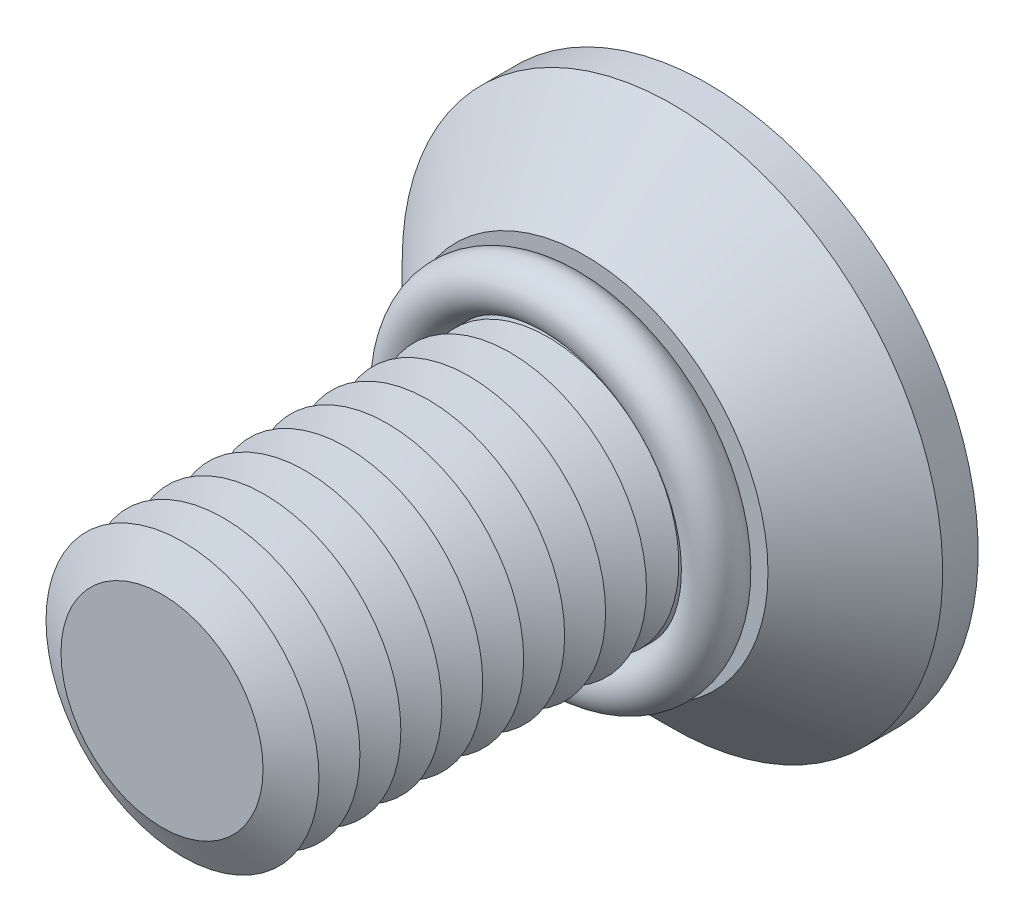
ISO-10303-21;
HEADER;
FILE_DESCRIPTION(('STEP AP214'),'2;1');
FILE_NAME('part.step','',(''),(''),'','','');
FILE_SCHEMA(('AUTOMOTIVE_DESIGN { 1 0 10303 214 1 1 1 1 }'));
ENDSEC;
DATA;
#1=APPLICATION_CONTEXT('core data for automotive mechanical design processes');
#2=APPLICATION_PROTOCOL_DEFINITION('international standard','automotive_design',2000,#1);
#3=PRODUCT_CONTEXT('',#1,'mechanical');
#4=PRODUCT('Part','Part','',(#3));
#5=PRODUCT_RELATED_PRODUCT_CATEGORY('part','',(#4));
#6=PRODUCT_DEFINITION_FORMATION('','',#4);
#7=PRODUCT_DEFINITION_CONTEXT('part definition',#1,'design');
#8=PRODUCT_DEFINITION('design','',#6,#7);
#9=PRODUCT_DEFINITION_SHAPE('','',#8);
#10=(LENGTH_UNIT() NAMED_UNIT(*) SI_UNIT(.MILLI.,.METRE.));
#11=(NAMED_UNIT(*) PLANE_ANGLE_UNIT() SI_UNIT($,.RADIAN.));
#12=(NAMED_UNIT(*) SI_UNIT($,.STERADIAN.) SOLID_ANGLE_UNIT());
#13=UNCERTAINTY_MEASURE_WITH_UNIT(LENGTH_MEASURE(1.E-05),#10,'distance_accuracy_value','');
#14=(GEOMETRIC_REPRESENTATION_CONTEXT(3) GLOBAL_UNCERTAINTY_ASSIGNED_CONTEXT((#13)) GLOBAL_UNIT_ASSIGNED_CONTEXT((#10,
#11,#12)) REPRESENTATION_CONTEXT('',''));
#15=CARTESIAN_POINT('',(0.,0.,0.));
#16=DIRECTION('',(0.,0.,1.));
#17=DIRECTION('',(1.,0.,0.));
#18=AXIS2_PLACEMENT_3D('',#15,#16,#17);
#19=CARTESIAN_POINT('',(0.,0.,5.39999999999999));
#20=DIRECTION('',(0.,0.,1.));
#21=DIRECTION('',(1.,0.,0.));
#22=AXIS2_PLACEMENT_3D('',#19,#20,#21);
#23=TOROIDAL_SURFACE('',#22,5.7,0.9);
#24=CARTESIAN_POINT('',(0.,5.7,5.39999999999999));
#25=DIRECTION('',(1.,0.,0.));
#26=DIRECTION('',(0.,0.,-1.));
#27=AXIS2_PLACEMENT_3D('',#24,#25,#26);
#28=CIRCLE('',#27,0.9);
#29=CARTESIAN_POINT('',(0.,6.6,5.39999999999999));
#30=VERTEX_POINT('',#29);
#31=EDGE_CURVE('P0_E10',#30,#30,#28,.T.);
#32=CARTESIAN_POINT('',(0.,0.,5.39999999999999));
#33=DIRECTION('',(0.,0.,1.));
#34=DIRECTION('',(1.,0.,0.));
#35=AXIS2_PLACEMENT_3D('',#32,#33,#34);
#36=CIRCLE('',#35,6.6);
#37=EDGE_CURVE('',#30,#30,#36,.T.);
#38=ORIENTED_EDGE('',*,*,#31,.F.);
#39=ORIENTED_EDGE('',*,*,#31,.T.);
#40=ORIENTED_EDGE('',*,*,#37,.T.);
#41=ORIENTED_EDGE('',*,*,#37,.F.);
#42=EDGE_LOOP('',(#38,#40,#39,#41));
#43=FACE_BOUND('',#42,.T.);
#44=ADVANCED_FACE('P0_F14',(#43),#23,.T.);
#45=CLOSED_SHELL('',(#44));
#46=MANIFOLD_SOLID_BREP('P0_B1',#45);
#47=CARTESIAN_POINT('',(0.,0.,12.5));
#48=DIRECTION('',(0.,0.,-1.));
#49=DIRECTION('',(-1.,0.,0.));
#50=AXIS2_PLACEMENT_3D('',#47,#48,#49);
#51=CONICAL_SURFACE('',#50,3.70096189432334,1.0471975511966);
#52=CARTESIAN_POINT('',(0.,0.,11.75));
#53=DIRECTION('',(0.,0.,1.));
#54=DIRECTION('',(1.,0.,0.));
#55=AXIS2_PLACEMENT_3D('',#52,#53,#54);
#56=CIRCLE('',#55,5.);
#57=CARTESIAN_POINT('',(5.,0.,11.75));
#58=VERTEX_POINT('',#57);
#59=EDGE_CURVE('P1_E324',#58,#58,#56,.T.);
#60=ORIENTED_EDGE('',*,*,#59,.T.);
#61=EDGE_LOOP('',(#60));
#62=FACE_BOUND('',#61,.T.);
#63=CARTESIAN_POINT('',(0.,0.,12.5));
#64=DIRECTION('',(0.,0.,1.));
#65=DIRECTION('',(1.,0.,0.));
#66=AXIS2_PLACEMENT_3D('',#63,#64,#65);
#67=CIRCLE('',#66,3.70096189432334);
#68=CARTESIAN_POINT('',(3.70096189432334,0.,12.5));
#69=VERTEX_POINT('',#68);
#70=EDGE_CURVE('P1_E321',#69,#69,#67,.T.);
#71=ORIENTED_EDGE('',*,*,#70,.F.);
#72=EDGE_LOOP('',(#71));
#73=FACE_BOUND('',#72,.T.);
#74=ADVANCED_FACE('P1_F15',(#62,#73),#51,.T.);
#75=CARTESIAN_POINT('',(0.,0.,13.25));
#76=DIRECTION('',(0.,0.,1.));
#77=DIRECTION('',(1.,0.,0.));
#78=AXIS2_PLACEMENT_3D('',#75,#76,#77);
#79=CONICAL_SURFACE('',#78,5.,1.0471975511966);
#80=ORIENTED_EDGE('',*,*,#70,.T.);
#81=EDGE_LOOP('',(#80));
#82=FACE_BOUND('',#81,.T.);
#83=CARTESIAN_POINT('',(0.,0.,13.25));
#84=DIRECTION('',(0.,0.,1.));
#85=DIRECTION('',(1.,0.,0.));
#86=AXIS2_PLACEMENT_3D('',#83,#84,#85);
#87=CIRCLE('',#86,5.);
#88=CARTESIAN_POINT('',(5.,0.,13.25));
#89=VERTEX_POINT('',#88);
#90=EDGE_CURVE('P1_E318',#89,#89,#87,.T.);
#91=ORIENTED_EDGE('',*,*,#90,.F.);
#92=EDGE_LOOP('',(#91));
#93=FACE_BOUND('',#92,.T.);
#94=ADVANCED_FACE('P1_F245',(#82,#93),#79,.T.);
#95=CARTESIAN_POINT('',(0.,0.,20.));
#96=DIRECTION('',(0.,0.,1.));
#97=DIRECTION('',(1.,0.,0.));
#98=AXIS2_PLACEMENT_3D('',#95,#96,#97);
#99=PLANE('',#98);
#100=CARTESIAN_POINT('',(0.,0.,20.));
#101=DIRECTION('',(0.,0.,1.));
#102=DIRECTION('',(1.,0.,0.));
#103=AXIS2_PLACEMENT_3D('',#100,#101,#102);
#104=CIRCLE('',#103,3.70096189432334);
#105=CARTESIAN_POINT('',(3.70096189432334,0.,20.));
#106=VERTEX_POINT('',#105);
#107=EDGE_CURVE('P1_E131',#106,#106,#104,.T.);
#108=ORIENTED_EDGE('',*,*,#107,.T.);
#109=EDGE_LOOP('',(#108));
#110=FACE_BOUND('',#109,.T.);
#111=ADVANCED_FACE('P1_F251',(#110),#99,.T.);
#112=CARTESIAN_POINT('',(0.,0.,20.));
#113=DIRECTION('',(0.,0.,-1.));
#114=DIRECTION('',(-1.,0.,0.));
#115=AXIS2_PLACEMENT_3D('',#112,#113,#114);
#116=CONICAL_SURFACE('',#115,3.70096189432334,1.0471975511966);
#117=CARTESIAN_POINT('',(0.,0.,19.25));
#118=DIRECTION('',(0.,0.,1.));
#119=DIRECTION('',(1.,0.,0.));
#120=AXIS2_PLACEMENT_3D('',#117,#118,#119);
#121=CIRCLE('',#120,5.);
#122=CARTESIAN_POINT('',(5.,0.,19.25));
#123=VERTEX_POINT('',#122);
#124=EDGE_CURVE('P1_E133',#123,#123,#121,.T.);
#125=ORIENTED_EDGE('',*,*,#124,.T.);
#126=EDGE_LOOP('',(#125));
#127=FACE_BOUND('',#126,.T.);
#128=ORIENTED_EDGE('',*,*,#107,.F.);
#129=EDGE_LOOP('',(#128));
#130=FACE_BOUND('',#129,.T.);
#131=ADVANCED_FACE('P1_F196',(#127,#130),#116,.T.);
#132=CARTESIAN_POINT('',(0.,0.,19.25));
#133=DIRECTION('',(0.,0.,1.));
#134=DIRECTION('',(1.,0.,0.));
#135=AXIS2_PLACEMENT_3D('',#132,#133,#134);
#136=CONICAL_SURFACE('',#135,5.,1.0471975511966);
#137=CARTESIAN_POINT('',(0.,0.,18.5));
#138=DIRECTION('',(0.,0.,1.));
#139=DIRECTION('',(1.,0.,0.));
#140=AXIS2_PLACEMENT_3D('',#137,#138,#139);
#141=CIRCLE('',#140,3.70096189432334);
#142=CARTESIAN_POINT('',(3.70096189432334,0.,18.5));
#143=VERTEX_POINT('',#142);
#144=EDGE_CURVE('P1_E297',#143,#143,#141,.T.);
#145=ORIENTED_EDGE('',*,*,#144,.T.);
#146=EDGE_LOOP('',(#145));
#147=FACE_BOUND('',#146,.T.);
#148=ORIENTED_EDGE('',*,*,#124,.F.);
#149=EDGE_LOOP('',(#148));
#150=FACE_BOUND('',#149,.T.);
#151=ADVANCED_FACE('P1_F284',(#147,#150),#136,.T.);
#152=CARTESIAN_POINT('',(0.,0.,18.5));
#153=DIRECTION('',(0.,0.,-1.));
#154=DIRECTION('',(-1.,0.,0.));
#155=AXIS2_PLACEMENT_3D('',#152,#153,#154);
#156=CONICAL_SURFACE('',#155,3.70096189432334,1.0471975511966);
#157=CARTESIAN_POINT('',(0.,0.,17.75));
#158=DIRECTION('',(0.,0.,1.));
#159=DIRECTION('',(1.,0.,0.));
#160=AXIS2_PLACEMENT_3D('',#157,#158,#159);
#161=CIRCLE('',#160,5.);
#162=CARTESIAN_POINT('',(5.,0.,17.75));
#163=VERTEX_POINT('',#162);
#164=EDGE_CURVE('P1_E294',#163,#163,#161,.T.);
#165=ORIENTED_EDGE('',*,*,#164,.T.);
#166=EDGE_LOOP('',(#165));
#167=FACE_BOUND('',#166,.T.);
#168=ORIENTED_EDGE('',*,*,#144,.F.);
#169=EDGE_LOOP('',(#168));
#170=FACE_BOUND('',#169,.T.);
#171=ADVANCED_FACE('P1_F279',(#167,#170),#156,.T.);
#172=CARTESIAN_POINT('',(0.,0.,17.75));
#173=DIRECTION('',(0.,0.,1.));
#174=DIRECTION('',(1.,0.,0.));
#175=AXIS2_PLACEMENT_3D('',#172,#173,#174);
#176=CONICAL_SURFACE('',#175,5.,1.0471975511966);
#177=CARTESIAN_POINT('',(0.,0.,17.));
#178=DIRECTION('',(0.,0.,1.));
#179=DIRECTION('',(1.,0.,0.));
#180=AXIS2_PLACEMENT_3D('',#177,#178,#179);
#181=CIRCLE('',#180,3.70096189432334);
#182=CARTESIAN_POINT('',(3.70096189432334,0.,17.));
#183=VERTEX_POINT('',#182);
#184=EDGE_CURVE('P1_E301',#183,#183,#181,.T.);
#185=ORIENTED_EDGE('',*,*,#184,.T.);
#186=EDGE_LOOP('',(#185));
#187=FACE_BOUND('',#186,.T.);
#188=ORIENTED_EDGE('',*,*,#164,.F.);
#189=EDGE_LOOP('',(#188));
#190=FACE_BOUND('',#189,.T.);
#191=ADVANCED_FACE('P1_F276',(#187,#190),#176,.T.);
#192=CARTESIAN_POINT('',(0.,0.,17.));
#193=DIRECTION('',(0.,0.,-1.));
#194=DIRECTION('',(-1.,0.,0.));
#195=AXIS2_PLACEMENT_3D('',#192,#193,#194);
#196=CONICAL_SURFACE('',#195,3.70096189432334,1.0471975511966);
#197=CARTESIAN_POINT('',(0.,0.,16.25));
#198=DIRECTION('',(0.,0.,1.));
#199=DIRECTION('',(1.,0.,0.));
#200=AXIS2_PLACEMENT_3D('',#197,#198,#199);
#201=CIRCLE('',#200,5.);
#202=CARTESIAN_POINT('',(5.,0.,16.25));
#203=VERTEX_POINT('',#202);
#204=EDGE_CURVE('P1_E306',#203,#203,#201,.T.);
#205=ORIENTED_EDGE('',*,*,#204,.T.);
#206=EDGE_LOOP('',(#205));
#207=FACE_BOUND('',#206,.T.);
#208=ORIENTED_EDGE('',*,*,#184,.F.);
#209=EDGE_LOOP('',(#208));
#210=FACE_BOUND('',#209,.T.);
#211=ADVANCED_FACE('P1_F271',(#207,#210),#196,.T.);
#212=CARTESIAN_POINT('',(0.,0.,16.25));
#213=DIRECTION('',(0.,0.,1.));
#214=DIRECTION('',(1.,0.,0.));
#215=AXIS2_PLACEMENT_3D('',#212,#213,#214);
#216=CONICAL_SURFACE('',#215,5.,1.0471975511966);
#217=CARTESIAN_POINT('',(0.,0.,15.5));
#218=DIRECTION('',(0.,0.,1.));
#219=DIRECTION('',(1.,0.,0.));
#220=AXIS2_PLACEMENT_3D('',#217,#218,#219);
#221=CIRCLE('',#220,3.70096189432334);
#222=CARTESIAN_POINT('',(3.70096189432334,0.,15.5));
#223=VERTEX_POINT('',#222);
#224=EDGE_CURVE('P1_E309',#223,#223,#221,.T.);
#225=ORIENTED_EDGE('',*,*,#224,.T.);
#226=EDGE_LOOP('',(#225));
#227=FACE_BOUND('',#226,.T.);
#228=ORIENTED_EDGE('',*,*,#204,.F.);
#229=EDGE_LOOP('',(#228));
#230=FACE_BOUND('',#229,.T.);
#231=ADVANCED_FACE('P1_F268',(#227,#230),#216,.T.);
#232=CARTESIAN_POINT('',(0.,0.,15.5));
#233=DIRECTION('',(0.,0.,-1.));
#234=DIRECTION('',(-1.,0.,0.));
#235=AXIS2_PLACEMENT_3D('',#232,#233,#234);
#236=CONICAL_SURFACE('',#235,3.70096189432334,1.0471975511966);
#237=CARTESIAN_POINT('',(0.,0.,14.75));
#238=DIRECTION('',(0.,0.,1.));
#239=DIRECTION('',(1.,0.,0.));
#240=AXIS2_PLACEMENT_3D('',#237,#238,#239);
#241=CIRCLE('',#240,5.);
#242=CARTESIAN_POINT('',(5.,0.,14.75));
#243=VERTEX_POINT('',#242);
#244=EDGE_CURVE('P1_E312',#243,#243,#241,.T.);
#245=ORIENTED_EDGE('',*,*,#244,.T.);
#246=EDGE_LOOP('',(#245));
#247=FACE_BOUND('',#246,.T.);
#248=ORIENTED_EDGE('',*,*,#224,.F.);
#249=EDGE_LOOP('',(#248));
#250=FACE_BOUND('',#249,.T.);
#251=ADVANCED_FACE('P1_F262',(#247,#250),#236,.T.);
#252=CARTESIAN_POINT('',(0.,0.,14.75));
#253=DIRECTION('',(0.,0.,1.));
#254=DIRECTION('',(1.,0.,0.));
#255=AXIS2_PLACEMENT_3D('',#252,#253,#254);
#256=CONICAL_SURFACE('',#255,5.,1.0471975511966);
#257=CARTESIAN_POINT('',(0.,0.,14.));
#258=DIRECTION('',(0.,0.,1.));
#259=DIRECTION('',(1.,0.,0.));
#260=AXIS2_PLACEMENT_3D('',#257,#258,#259);
#261=CIRCLE('',#260,3.70096189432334);
#262=CARTESIAN_POINT('',(3.70096189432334,0.,14.));
#263=VERTEX_POINT('',#262);
#264=EDGE_CURVE('P1_E315',#263,#263,#261,.T.);
#265=ORIENTED_EDGE('',*,*,#264,.T.);
#266=EDGE_LOOP('',(#265));
#267=FACE_BOUND('',#266,.T.);
#268=ORIENTED_EDGE('',*,*,#244,.F.);
#269=EDGE_LOOP('',(#268));
#270=FACE_BOUND('',#269,.T.);
#271=ADVANCED_FACE('P1_F258',(#267,#270),#256,.T.);
#272=CARTESIAN_POINT('',(0.,0.,14.));
#273=DIRECTION('',(0.,0.,-1.));
#274=DIRECTION('',(-1.,0.,0.));
#275=AXIS2_PLACEMENT_3D('',#272,#273,#274);
#276=CONICAL_SURFACE('',#275,3.70096189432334,1.0471975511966);
#277=ORIENTED_EDGE('',*,*,#90,.T.);
#278=EDGE_LOOP('',(#277));
#279=FACE_BOUND('',#278,.T.);
#280=ORIENTED_EDGE('',*,*,#264,.F.);
#281=EDGE_LOOP('',(#280));
#282=FACE_BOUND('',#281,.T.);
#283=ADVANCED_FACE('P1_F261',(#279,#282),#276,.T.);
#284=CARTESIAN_POINT('',(0.,0.,11.));
#285=DIRECTION('',(0.,0.,-1.));
#286=DIRECTION('',(-1.,0.,0.));
#287=AXIS2_PLACEMENT_3D('',#284,#285,#286);
#288=CONICAL_SURFACE('',#287,3.70096189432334,1.0471975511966);
#289=CARTESIAN_POINT('',(0.,0.,10.25));
#290=DIRECTION('',(0.,0.,1.));
#291=DIRECTION('',(1.,0.,0.));
#292=AXIS2_PLACEMENT_3D('',#289,#290,#291);
#293=CIRCLE('',#292,5.);
#294=CARTESIAN_POINT('',(5.,0.,10.25));
#295=VERTEX_POINT('',#294);
#296=EDGE_CURVE('P1_E329',#295,#295,#293,.T.);
#297=ORIENTED_EDGE('',*,*,#296,.T.);
#298=EDGE_LOOP('',(#297));
#299=FACE_BOUND('',#298,.T.);
#300=CARTESIAN_POINT('',(0.,0.,11.));
#301=DIRECTION('',(0.,0.,1.));
#302=DIRECTION('',(1.,0.,0.));
#303=AXIS2_PLACEMENT_3D('',#300,#301,#302);
#304=CIRCLE('',#303,3.70096189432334);
#305=CARTESIAN_POINT('',(3.70096189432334,0.,11.));
#306=VERTEX_POINT('',#305);
#307=EDGE_CURVE('P1_E326',#306,#306,#304,.T.);
#308=ORIENTED_EDGE('',*,*,#307,.F.);
#309=EDGE_LOOP('',(#308));
#310=FACE_BOUND('',#309,.T.);
#311=ADVANCED_FACE('P1_F266',(#299,#310),#288,.T.);
#312=CARTESIAN_POINT('',(0.,0.,11.75));
#313=DIRECTION('',(0.,0.,1.));
#314=DIRECTION('',(1.,0.,0.));
#315=AXIS2_PLACEMENT_3D('',#312,#313,#314);
#316=CONICAL_SURFACE('',#315,5.,1.0471975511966);
#317=ORIENTED_EDGE('',*,*,#307,.T.);
#318=EDGE_LOOP('',(#317));
#319=FACE_BOUND('',#318,.T.);
#320=ORIENTED_EDGE('',*,*,#59,.F.);
#321=EDGE_LOOP('',(#320));
#322=FACE_BOUND('',#321,.T.);
#323=ADVANCED_FACE('P1_F449',(#319,#322),#316,.T.);
#324=CARTESIAN_POINT('',(0.,0.,9.5));
#325=DIRECTION('',(0.,0.,-1.));
#326=DIRECTION('',(-1.,0.,0.));
#327=AXIS2_PLACEMENT_3D('',#324,#325,#326);
#328=CONICAL_SURFACE('',#327,3.70096189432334,1.0471975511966);
#329=CARTESIAN_POINT('',(0.,0.,8.75));
#330=DIRECTION('',(0.,0.,1.));
#331=DIRECTION('',(1.,0.,0.));
#332=AXIS2_PLACEMENT_3D('',#329,#330,#331);
#333=CIRCLE('',#332,5.);
#334=CARTESIAN_POINT('',(5.,0.,8.75));
#335=VERTEX_POINT('',#334);
#336=EDGE_CURVE('P1_E335',#335,#335,#333,.T.);
#337=ORIENTED_EDGE('',*,*,#336,.T.);
#338=EDGE_LOOP('',(#337));
#339=FACE_BOUND('',#338,.T.);
#340=CARTESIAN_POINT('',(0.,0.,9.5));
#341=DIRECTION('',(0.,0.,1.));
#342=DIRECTION('',(1.,0.,0.));
#343=AXIS2_PLACEMENT_3D('',#340,#341,#342);
#344=CIRCLE('',#343,3.70096189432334);
#345=CARTESIAN_POINT('',(3.70096189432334,0.,9.5));
#346=VERTEX_POINT('',#345);
#347=EDGE_CURVE('P1_E332',#346,#346,#344,.T.);
#348=ORIENTED_EDGE('',*,*,#347,.F.);
#349=EDGE_LOOP('',(#348));
#350=FACE_BOUND('',#349,.T.);
#351=ADVANCED_FACE('P1_F458',(#339,#350),#328,.T.);
#352=CARTESIAN_POINT('',(0.,0.,10.25));
#353=DIRECTION('',(0.,0.,1.));
#354=DIRECTION('',(1.,0.,0.));
#355=AXIS2_PLACEMENT_3D('',#352,#353,#354);
#356=CONICAL_SURFACE('',#355,5.,1.0471975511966);
#357=ORIENTED_EDGE('',*,*,#347,.T.);
#358=EDGE_LOOP('',(#357));
#359=FACE_BOUND('',#358,.T.);
#360=ORIENTED_EDGE('',*,*,#296,.F.);
#361=EDGE_LOOP('',(#360));
#362=FACE_BOUND('',#361,.T.);
#363=ADVANCED_FACE('P1_F468',(#359,#362),#356,.T.);
#364=CARTESIAN_POINT('',(0.,0.,8.));
#365=DIRECTION('',(0.,0.,-1.));
#366=DIRECTION('',(-1.,0.,0.));
#367=AXIS2_PLACEMENT_3D('',#364,#365,#366);
#368=CONICAL_SURFACE('',#367,3.70096189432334,1.0471975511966);
#369=CARTESIAN_POINT('',(0.,0.,7.25));
#370=DIRECTION('',(0.,0.,1.));
#371=DIRECTION('',(1.,0.,0.));
#372=AXIS2_PLACEMENT_3D('',#369,#370,#371);
#373=CIRCLE('',#372,5.);
#374=CARTESIAN_POINT('',(5.,0.,7.25));
#375=VERTEX_POINT('',#374);
#376=EDGE_CURVE('P1_E341',#375,#375,#373,.T.);
#377=ORIENTED_EDGE('',*,*,#376,.T.);
#378=EDGE_LOOP('',(#377));
#379=FACE_BOUND('',#378,.T.);
#380=CARTESIAN_POINT('',(0.,0.,8.));
#381=DIRECTION('',(0.,0.,1.));
#382=DIRECTION('',(1.,0.,0.));
#383=AXIS2_PLACEMENT_3D('',#380,#381,#382);
#384=CIRCLE('',#383,3.70096189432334);
#385=CARTESIAN_POINT('',(3.70096189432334,0.,8.));
#386=VERTEX_POINT('',#385);
#387=EDGE_CURVE('P1_E338',#386,#386,#384,.T.);
#388=ORIENTED_EDGE('',*,*,#387,.F.);
#389=EDGE_LOOP('',(#388));
#390=FACE_BOUND('',#389,.T.);
#391=ADVANCED_FACE('P1_F478',(#379,#390),#368,.T.);
#392=CARTESIAN_POINT('',(0.,0.,8.75));
#393=DIRECTION('',(0.,0.,1.));
#394=DIRECTION('',(1.,0.,0.));
#395=AXIS2_PLACEMENT_3D('',#392,#393,#394);
#396=CONICAL_SURFACE('',#395,5.,1.0471975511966);
#397=ORIENTED_EDGE('',*,*,#387,.T.);
#398=EDGE_LOOP('',(#397));
#399=FACE_BOUND('',#398,.T.);
#400=ORIENTED_EDGE('',*,*,#336,.F.);
#401=EDGE_LOOP('',(#400));
#402=FACE_BOUND('',#401,.T.);
#403=ADVANCED_FACE('P1_F354',(#399,#402),#396,.T.);
#404=CARTESIAN_POINT('',(0.,0.,6.5));
#405=DIRECTION('',(0.,0.,-1.));
#406=DIRECTION('',(-1.,0.,0.));
#407=AXIS2_PLACEMENT_3D('',#404,#405,#406);
#408=CONICAL_SURFACE('',#407,3.70096189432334,1.0471975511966);
#409=CARTESIAN_POINT('',(0.,0.,6.5));
#410=DIRECTION('',(0.,0.,1.));
#411=DIRECTION('',(1.,0.,0.));
#412=AXIS2_PLACEMENT_3D('',#409,#410,#411);
#413=CIRCLE('',#412,3.70096189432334);
#414=CARTESIAN_POINT('',(3.70096189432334,0.,6.5));
#415=VERTEX_POINT('',#414);
#416=EDGE_CURVE('P1_E344',#415,#415,#413,.T.);
#417=ORIENTED_EDGE('',*,*,#416,.F.);
#418=EDGE_LOOP('',(#417));
#419=FACE_BOUND('',#418,.T.);
#420=CARTESIAN_POINT('',(0.,0.,5.86547005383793));
#421=DIRECTION('',(0.,0.,-1.));
#422=DIRECTION('',(-1.,0.,0.));
#423=AXIS2_PLACEMENT_3D('',#420,#421,#422);
#424=CIRCLE('',#423,4.8);
#425=CARTESIAN_POINT('',(-4.8,0.,5.86547005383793));
#426=VERTEX_POINT('',#425);
#427=EDGE_CURVE('P1_E19',#426,#426,#424,.F.);
#428=ORIENTED_EDGE('',*,*,#427,.T.);
#429=EDGE_LOOP('',(#428));
#430=FACE_BOUND('',#429,.T.);
#431=ADVANCED_FACE('P1_F351',(#419,#430),#408,.T.);
#432=CARTESIAN_POINT('',(0.,0.,7.25));
#433=DIRECTION('',(0.,0.,1.));
#434=DIRECTION('',(1.,0.,0.));
#435=AXIS2_PLACEMENT_3D('',#432,#433,#434);
#436=CONICAL_SURFACE('',#435,5.,1.0471975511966);
#437=ORIENTED_EDGE('',*,*,#416,.T.);
#438=EDGE_LOOP('',(#437));
#439=FACE_BOUND('',#438,.T.);
#440=ORIENTED_EDGE('',*,*,#376,.F.);
#441=EDGE_LOOP('',(#440));
#442=FACE_BOUND('',#441,.T.);
#443=ADVANCED_FACE('P1_F348',(#439,#442),#436,.T.);
#444=CARTESIAN_POINT('',(0.,0.,4.));
#445=DIRECTION('',(0.,0.,-1.));
#446=DIRECTION('',(-1.,0.,0.));
#447=AXIS2_PLACEMENT_3D('',#444,#445,#446);
#448=CONICAL_SURFACE('',#447,3.,1.0471975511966);
#449=CARTESIAN_POINT('',(0.,0.,5.73205080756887));
#450=VERTEX_POINT('',#449);
#451=VERTEX_LOOP('',#450);
#452=FACE_BOUND('',#451,.T.);
#453=CARTESIAN_POINT('',(0.,0.,4.));
#454=DIRECTION('',(0.,0.,-1.));
#455=DIRECTION('',(-1.,0.,0.));
#456=AXIS2_PLACEMENT_3D('',#453,#454,#455);
#457=CIRCLE('',#456,3.);
#458=CARTESIAN_POINT('',(-3.,0.,4.));
#459=VERTEX_POINT('',#458);
#460=CARTESIAN_POINT('',(-1.5,2.59807621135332,4.));
#461=VERTEX_POINT('',#460);
#462=EDGE_CURVE('P1_E117',#459,#461,#457,.T.);
#463=ORIENTED_EDGE('',*,*,#462,.T.);
#464=CARTESIAN_POINT('',(0.,0.,4.));
#465=DIRECTION('',(0.,0.,-1.));
#466=DIRECTION('',(-1.,0.,0.));
#467=AXIS2_PLACEMENT_3D('',#464,#465,#466);
#468=CIRCLE('',#467,3.);
#469=CARTESIAN_POINT('',(1.5,2.59807621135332,4.));
#470=VERTEX_POINT('',#469);
#471=EDGE_CURVE('P1_E24',#461,#470,#468,.T.);
#472=ORIENTED_EDGE('',*,*,#471,.T.);
#473=CARTESIAN_POINT('',(3.,0.,4.));
#474=VERTEX_POINT('',#473);
#475=EDGE_CURVE('P1_E713',#470,#474,#468,.T.);
#476=ORIENTED_EDGE('',*,*,#475,.T.);
#477=CARTESIAN_POINT('',(1.5,-2.59807621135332,4.));
#478=VERTEX_POINT('',#477);
#479=EDGE_CURVE('P1_E706',#474,#478,#468,.T.);
#480=ORIENTED_EDGE('',*,*,#479,.T.);
#481=CARTESIAN_POINT('',(-1.5,-2.59807621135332,4.));
#482=VERTEX_POINT('',#481);
#483=EDGE_CURVE('P1_E182',#478,#482,#468,.T.);
#484=ORIENTED_EDGE('',*,*,#483,.T.);
#485=EDGE_CURVE('P1_E179',#482,#459,#468,.T.);
#486=ORIENTED_EDGE('',*,*,#485,.T.);
#487=EDGE_LOOP('',(#463,#472,#476,#480,#484,#486));
#488=FACE_BOUND('',#487,.T.);
#489=ADVANCED_FACE('P1_F198',(#452,#488),#448,.F.);
#490=CARTESIAN_POINT('',(0.,0.,4.));
#491=DIRECTION('',(0.,0.,-1.));
#492=DIRECTION('',(-1.,0.,0.));
#493=AXIS2_PLACEMENT_3D('',#490,#491,#492);
#494=PLANE('',#493);
#495=ORIENTED_EDGE('',*,*,#483,.F.);
#496=DIRECTION('',(-0.866025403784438,-0.5,0.));
#497=VECTOR('',#496,1.);
#498=CARTESIAN_POINT('',(3.,-1.73205080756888,4.));
#499=LINE('',#498,#497);
#500=CARTESIAN_POINT('',(0.,-3.46410161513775,4.));
#501=VERTEX_POINT('',#500);
#502=EDGE_CURVE('P1_E722',#478,#501,#499,.T.);
#503=ORIENTED_EDGE('',*,*,#502,.T.);
#504=DIRECTION('',(-0.866025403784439,0.5,0.));
#505=VECTOR('',#504,1.);
#506=CARTESIAN_POINT('',(0.,-3.46410161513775,4.));
#507=LINE('',#506,#505);
#508=EDGE_CURVE('P1_E729',#501,#482,#507,.T.);
#509=ORIENTED_EDGE('',*,*,#508,.T.);
#510=EDGE_LOOP('',(#495,#503,#509));
#511=FACE_BOUND('',#510,.T.);
#512=ADVANCED_FACE('P1_F520',(#511),#494,.T.);
#513=ORIENTED_EDGE('',*,*,#485,.F.);
#514=CARTESIAN_POINT('',(-3.,-1.73205080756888,4.));
#515=VERTEX_POINT('',#514);
#516=EDGE_CURVE('P1_E732',#482,#515,#507,.T.);
#517=ORIENTED_EDGE('',*,*,#516,.T.);
#518=DIRECTION('',(0.,1.,0.));
#519=VECTOR('',#518,1.);
#520=CARTESIAN_POINT('',(-3.,-1.73205080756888,4.));
#521=LINE('',#520,#519);
#522=EDGE_CURVE('P1_E123',#515,#459,#521,.T.);
#523=ORIENTED_EDGE('',*,*,#522,.T.);
#524=EDGE_LOOP('',(#513,#517,#523));
#525=FACE_BOUND('',#524,.T.);
#526=ADVANCED_FACE('P1_F231',(#525),#494,.T.);
#527=ORIENTED_EDGE('',*,*,#462,.F.);
#528=CARTESIAN_POINT('',(-3.,1.73205080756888,4.));
#529=VERTEX_POINT('',#528);
#530=EDGE_CURVE('P1_E734',#459,#529,#521,.T.);
#531=ORIENTED_EDGE('',*,*,#530,.T.);
#532=DIRECTION('',(0.866025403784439,0.5,0.));
#533=VECTOR('',#532,1.);
#534=CARTESIAN_POINT('',(-3.,1.73205080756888,4.));
#535=LINE('',#534,#533);
#536=EDGE_CURVE('P1_E737',#529,#461,#535,.T.);
#537=ORIENTED_EDGE('',*,*,#536,.T.);
#538=EDGE_LOOP('',(#527,#531,#537));
#539=FACE_BOUND('',#538,.T.);
#540=ADVANCED_FACE('P1_F537',(#539),#494,.T.);
#541=ORIENTED_EDGE('',*,*,#471,.F.);
#542=CARTESIAN_POINT('',(0.,3.46410161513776,4.));
#543=VERTEX_POINT('',#542);
#544=EDGE_CURVE('P1_E736',#461,#543,#535,.T.);
#545=ORIENTED_EDGE('',*,*,#544,.T.);
#546=DIRECTION('',(0.866025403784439,-0.5,0.));
#547=VECTOR('',#546,1.);
#548=CARTESIAN_POINT('',(0.,3.46410161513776,4.));
#549=LINE('',#548,#547);
#550=EDGE_CURVE('P1_E161',#543,#470,#549,.T.);
#551=ORIENTED_EDGE('',*,*,#550,.T.);
#552=EDGE_LOOP('',(#541,#545,#551));
#553=FACE_BOUND('',#552,.T.);
#554=ADVANCED_FACE('P1_F546',(#553),#494,.T.);
#555=ORIENTED_EDGE('',*,*,#475,.F.);
#556=CARTESIAN_POINT('',(3.,1.73205080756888,4.));
#557=VERTEX_POINT('',#556);
#558=EDGE_CURVE('P1_E721',#470,#557,#549,.T.);
#559=ORIENTED_EDGE('',*,*,#558,.T.);
#560=DIRECTION('',(0.,-1.,0.));
#561=VECTOR('',#560,1.);
#562=CARTESIAN_POINT('',(3.,1.73205080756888,4.));
#563=LINE('',#562,#561);
#564=EDGE_CURVE('P1_E716',#557,#474,#563,.T.);
#565=ORIENTED_EDGE('',*,*,#564,.T.);
#566=EDGE_LOOP('',(#555,#559,#565));
#567=FACE_BOUND('',#566,.T.);
#568=ADVANCED_FACE('P1_F555',(#567),#494,.T.);
#569=ORIENTED_EDGE('',*,*,#479,.F.);
#570=CARTESIAN_POINT('',(3.,-1.73205080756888,4.));
#571=VERTEX_POINT('',#570);
#572=EDGE_CURVE('P1_E708',#474,#571,#563,.T.);
#573=ORIENTED_EDGE('',*,*,#572,.T.);
#574=EDGE_CURVE('P1_E125',#571,#478,#499,.T.);
#575=ORIENTED_EDGE('',*,*,#574,.T.);
#576=EDGE_LOOP('',(#569,#573,#575));
#577=FACE_BOUND('',#576,.T.);
#578=ADVANCED_FACE('P1_F229',(#577),#494,.T.);
#579=CARTESIAN_POINT('',(3.,-1.73205080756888,4.));
#580=DIRECTION('',(0.5,-0.866025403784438,0.));
#581=DIRECTION('',(0.866025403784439,0.5,0.));
#582=AXIS2_PLACEMENT_3D('',#579,#580,#581);
#583=PLANE('',#582);
#584=DIRECTION('',(0.,0.,-1.));
#585=VECTOR('',#584,1.);
#586=CARTESIAN_POINT('',(3.,-1.73205080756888,4.));
#587=LINE('',#586,#585);
#588=CARTESIAN_POINT('',(3.,-1.73205080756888,0.));
#589=VERTEX_POINT('',#588);
#590=EDGE_CURVE('P1_E164',#571,#589,#587,.T.);
#591=ORIENTED_EDGE('',*,*,#590,.T.);
#592=CARTESIAN_POINT('',(3.0002,-1.73193533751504,-3.09416546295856E-05));
#593=CARTESIAN_POINT('',(2.8756009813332,-1.80387261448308,0.0192538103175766));
#594=CARTESIAN_POINT('',(2.75077603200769,-1.87594033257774,0.036761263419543));
#595=CARTESIAN_POINT('',(2.50068525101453,-2.02033031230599,0.067520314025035));
#596=CARTESIAN_POINT('',(2.37541926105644,-2.0926526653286,0.0807701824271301));
#597=CARTESIAN_POINT('',(2.12520598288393,-2.23711336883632,0.102240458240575));
#598=CARTESIAN_POINT('',(2.00026038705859,-2.30925074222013,0.110486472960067));
#599=CARTESIAN_POINT('',(1.75020983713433,-2.45361749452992,0.121543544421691));
#600=CARTESIAN_POINT('',(1.62510491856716,-2.52584685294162,0.12435565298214));
#601=CARTESIAN_POINT('',(1.37489508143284,-2.67030556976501,0.12435565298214));
#602=CARTESIAN_POINT('',(1.24979016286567,-2.74253492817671,0.121543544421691));
#603=CARTESIAN_POINT('',(0.99973961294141,-2.8869016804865,0.110486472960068));
#604=CARTESIAN_POINT('',(0.874794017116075,-2.95903905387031,0.102240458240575));
#605=CARTESIAN_POINT('',(0.62458073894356,-3.10349975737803,0.0807701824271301));
#606=CARTESIAN_POINT('',(0.499314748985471,-3.17582211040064,0.067520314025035));
#607=CARTESIAN_POINT('',(0.249223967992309,-3.32021209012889,0.036761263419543));
#608=CARTESIAN_POINT('',(0.124399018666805,-3.39227980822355,0.0192538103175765));
#609=CARTESIAN_POINT('',(-0.000199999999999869,-3.46421708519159,-3.09416546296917E-05));
#610=B_SPLINE_CURVE_WITH_KNOTS('',3,(#592,#593,#594,#595,#596,#597,#598,#599,#600,#601,#602,
#603,#604,#605,#606,#607,#608,#609),.UNSPECIFIED.,.F.,.F.,(4,2,2,2,2,2,2,2,4),(0.,
0.435506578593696,0.871189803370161,1.30462418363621,1.73797465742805,2.17132513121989,
2.60475951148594,3.0404427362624,3.4759493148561),.UNSPECIFIED.);
#611=CARTESIAN_POINT('',(0.,-3.46410161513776,0.));
#612=VERTEX_POINT('',#611);
#613=EDGE_CURVE('P1_E118',#589,#612,#610,.T.);
#614=ORIENTED_EDGE('',*,*,#613,.T.);
#615=DIRECTION('',(0.,0.,-1.));
#616=VECTOR('',#615,1.);
#617=CARTESIAN_POINT('',(0.,-3.46410161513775,4.));
#618=LINE('',#617,#616);
#619=EDGE_CURVE('P1_E116',#501,#612,#618,.T.);
#620=ORIENTED_EDGE('',*,*,#619,.F.);
#621=ORIENTED_EDGE('',*,*,#502,.F.);
#622=ORIENTED_EDGE('',*,*,#574,.F.);
#623=EDGE_LOOP('',(#591,#614,#620,#621,#622));
#624=FACE_BOUND('',#623,.T.);
#625=ADVANCED_FACE('P1_F226',(#624),#583,.F.);
#626=CARTESIAN_POINT('',(0.,-3.46410161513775,4.));
#627=DIRECTION('',(-0.5,-0.866025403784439,0.));
#628=DIRECTION('',(0.866025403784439,-0.5,0.));
#629=AXIS2_PLACEMENT_3D('',#626,#627,#628);
#630=PLANE('',#629);
#631=ORIENTED_EDGE('',*,*,#619,.T.);
#632=CARTESIAN_POINT('',(0.000200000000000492,-3.46421708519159,-3.09416546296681E-05));
#633=CARTESIAN_POINT('',(-0.124399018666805,-3.39227980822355,0.0192538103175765));
#634=CARTESIAN_POINT('',(-0.249223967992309,-3.32021209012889,0.036761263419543));
#635=CARTESIAN_POINT('',(-0.49931474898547,-3.17582211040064,0.0675203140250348));
#636=CARTESIAN_POINT('',(-0.62458073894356,-3.10349975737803,0.08077018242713));
#637=CARTESIAN_POINT('',(-0.874794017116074,-2.95903905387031,0.102240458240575));
#638=CARTESIAN_POINT('',(-0.999739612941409,-2.8869016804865,0.110486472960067));
#639=CARTESIAN_POINT('',(-1.24979016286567,-2.74253492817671,0.121543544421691));
#640=CARTESIAN_POINT('',(-1.37489508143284,-2.67030556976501,0.12435565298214));
#641=CARTESIAN_POINT('',(-1.62510491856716,-2.52584685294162,0.12435565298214));
#642=CARTESIAN_POINT('',(-1.75020983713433,-2.45361749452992,0.12154354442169));
#643=CARTESIAN_POINT('',(-2.00026038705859,-2.30925074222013,0.110486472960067));
#644=CARTESIAN_POINT('',(-2.12520598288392,-2.23711336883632,0.102240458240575));
#645=CARTESIAN_POINT('',(-2.37541926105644,-2.0926526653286,0.08077018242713));
#646=CARTESIAN_POINT('',(-2.50068525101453,-2.02033031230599,0.0675203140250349));
#647=CARTESIAN_POINT('',(-2.75077603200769,-1.87594033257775,0.036761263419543));
#648=CARTESIAN_POINT('',(-2.87560098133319,-1.80387261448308,0.0192538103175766));
#649=CARTESIAN_POINT('',(-3.0002,-1.73193533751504,-3.09416546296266E-05));
#650=B_SPLINE_CURVE_WITH_KNOTS('',3,(#632,#633,#634,#635,#636,#637,#638,#639,#640,#641,#642,
#643,#644,#645,#646,#647,#648,#649),.UNSPECIFIED.,.F.,.F.,(4,2,2,2,2,2,2,2,4),(0.,
0.435506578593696,0.87118980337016,1.3046241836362,1.73797465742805,2.17132513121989,
2.60475951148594,3.0404427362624,3.4759493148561),.UNSPECIFIED.);
#651=CARTESIAN_POINT('',(-3.,-1.73205080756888,0.));
#652=VERTEX_POINT('',#651);
#653=EDGE_CURVE('P1_E94',#612,#652,#650,.T.);
#654=ORIENTED_EDGE('',*,*,#653,.T.);
#655=DIRECTION('',(0.,0.,-1.));
#656=VECTOR('',#655,1.);
#657=CARTESIAN_POINT('',(-3.,-1.73205080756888,4.));
#658=LINE('',#657,#656);
#659=EDGE_CURVE('P1_E112',#515,#652,#658,.T.);
#660=ORIENTED_EDGE('',*,*,#659,.F.);
#661=ORIENTED_EDGE('',*,*,#516,.F.);
#662=ORIENTED_EDGE('',*,*,#508,.F.);
#663=EDGE_LOOP('',(#631,#654,#660,#661,#662));
#664=FACE_BOUND('',#663,.T.);
#665=ADVANCED_FACE('P1_F110',(#664),#630,.F.);
#666=CARTESIAN_POINT('',(-3.,-1.73205080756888,4.));
#667=DIRECTION('',(-1.,0.,0.));
#668=DIRECTION('',(0.,-1.,0.));
#669=AXIS2_PLACEMENT_3D('',#666,#667,#668);
#670=PLANE('',#669);
#671=ORIENTED_EDGE('',*,*,#659,.T.);
#672=CARTESIAN_POINT('',(-3.,-4.52161137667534,-0.525775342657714));
#673=CARTESIAN_POINT('',(-3.,-4.38614690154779,-0.495537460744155));
#674=CARTESIAN_POINT('',(-3.,-4.25059605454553,-0.465680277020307));
#675=CARTESIAN_POINT('',(-3.,-3.97927914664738,-0.406931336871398));
#676=CARTESIAN_POINT('',(-3.,-3.84351307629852,-0.378039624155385));
#677=CARTESIAN_POINT('',(-3.,-3.57159492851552,-0.321399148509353));
#678=CARTESIAN_POINT('',(-3.,-3.43544259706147,-0.293651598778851));
#679=CARTESIAN_POINT('',(-3.,-3.16285056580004,-0.239614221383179));
#680=CARTESIAN_POINT('',(-3.,-3.02641086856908,-0.213324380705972));
#681=CARTESIAN_POINT('',(-3.,-2.61896324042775,-0.137569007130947));
#682=CARTESIAN_POINT('',(-3.,-2.34745999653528,-0.090713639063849));
#683=CARTESIAN_POINT('',(-3.,-1.80279754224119,-0.00770905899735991));
#684=CARTESIAN_POINT('',(-3.,-1.52963867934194,0.0284423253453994));
#685=CARTESIAN_POINT('',(-3.,-1.11712206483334,0.0711149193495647));
#686=CARTESIAN_POINT('',(-3.,-0.978367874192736,0.0834493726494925));
#687=CARTESIAN_POINT('',(-3.,-0.700531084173,0.103508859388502));
#688=CARTESIAN_POINT('',(-3.,-0.561448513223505,0.11123427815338));
#689=CARTESIAN_POINT('',(-3.,-0.283146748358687,0.121626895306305));
#690=CARTESIAN_POINT('',(-3.,-0.143927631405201,0.124296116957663));
#691=CARTESIAN_POINT('',(-3.,0.134513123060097,0.124413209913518));
#692=CARTESIAN_POINT('',(-3.,0.273734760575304,0.121861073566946));
#693=CARTESIAN_POINT('',(-3.,0.552556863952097,0.111676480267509));
#694=CARTESIAN_POINT('',(-3.,0.692156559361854,0.104023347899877));
#695=CARTESIAN_POINT('',(-3.,0.971024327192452,0.08406484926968));
#696=CARTESIAN_POINT('',(-3.,1.11029238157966,0.071759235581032));
#697=CARTESIAN_POINT('',(-3.,1.3884939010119,0.0431025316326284));
#698=CARTESIAN_POINT('',(-3.,1.52742710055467,0.0267489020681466));
#699=CARTESIAN_POINT('',(-3.,1.80484805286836,-0.00934194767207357));
#700=CARTESIAN_POINT('',(-3.,1.94333580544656,-0.0290791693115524));
#701=CARTESIAN_POINT('',(-3.,2.2235029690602,-0.0718742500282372));
#702=CARTESIAN_POINT('',(-3.,2.36517107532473,-0.0950054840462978));
#703=CARTESIAN_POINT('',(-3.,2.648104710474,-0.143617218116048));
#704=CARTESIAN_POINT('',(-3.,2.78937022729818,-0.169097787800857));
#705=CARTESIAN_POINT('',(-3.,3.21267286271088,-0.248342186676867));
#706=CARTESIAN_POINT('',(-3.,3.49418463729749,-0.304903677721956));
#707=CARTESIAN_POINT('',(-3.,4.05626646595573,-0.422827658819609));
#708=CARTESIAN_POINT('',(-3.,4.33683622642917,-0.484191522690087));
#709=CARTESIAN_POINT('',(-3.,4.89726247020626,-0.610112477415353));
#710=CARTESIAN_POINT('',(-3.,5.17711893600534,-0.67466964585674));
#711=CARTESIAN_POINT('',(-3.,5.73290235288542,-0.80517176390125));
#712=CARTESIAN_POINT('',(-3.,6.00883557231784,-0.87109015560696));
#713=CARTESIAN_POINT('',(-3.,6.56033924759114,-1.00445136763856));
#714=CARTESIAN_POINT('',(-3.,6.83590969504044,-1.07189422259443));
#715=CARTESIAN_POINT('',(-3.,7.38639195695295,-1.20779575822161));
#716=CARTESIAN_POINT('',(-3.,7.66130415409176,-1.27625289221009));
#717=CARTESIAN_POINT('',(-3.,8.21090603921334,-1.41401333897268));
#718=CARTESIAN_POINT('',(-3.,8.48559573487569,-1.48331662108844));
#719=CARTESIAN_POINT('',(-3.,8.76020986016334,-1.55291480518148));
#720=B_SPLINE_CURVE_WITH_KNOTS('',3,(#672,#673,#674,#675,#676,#677,#678,#679,#680,#681,#682,
#683,#684,#685,#686,#687,#688,#689,#690,#691,#692,#693,#694,#695,#696,#697,#698,#699,#700,#701,
#702,#703,#704,#705,#706,#707,#708,#709,#710,#711,#712,#713,#714,#715,#716,#717,#718,#719),
.UNSPECIFIED.,.F.,.F.,(4,2,2,2,2,2,2,2,2,2,2,2,2,2,2,2,2,2,2,2,2,2,2,4),(0.,0.416396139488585,
0.832811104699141,1.24965681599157,1.66649880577,2.49292514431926,3.31918364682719,
3.73702338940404,4.1548281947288,4.57246577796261,4.99010397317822,5.40944532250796,
5.82880897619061,6.24843636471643,6.66806393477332,7.09867155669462,7.52929194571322,
8.39062817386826,9.25221171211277,10.1138161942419,10.9649037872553,11.8160107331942,
12.6659315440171,13.5158216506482),.UNSPECIFIED.);
#721=CARTESIAN_POINT('',(-3.,1.73205080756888,0.));
#722=VERTEX_POINT('',#721);
#723=EDGE_CURVE('P1_E10',#652,#722,#720,.T.);
#724=ORIENTED_EDGE('',*,*,#723,.T.);
#725=DIRECTION('',(0.,0.,-1.));
#726=VECTOR('',#725,1.);
#727=CARTESIAN_POINT('',(-3.,1.73205080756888,4.));
#728=LINE('',#727,#726);
#729=EDGE_CURVE('P1_E124',#529,#722,#728,.T.);
#730=ORIENTED_EDGE('',*,*,#729,.F.);
#731=ORIENTED_EDGE('',*,*,#530,.F.);
#732=ORIENTED_EDGE('',*,*,#522,.F.);
#733=EDGE_LOOP('',(#671,#724,#730,#731,#732));
#734=FACE_BOUND('',#733,.T.);
#735=ADVANCED_FACE('P1_F120',(#734),#670,.F.);
#736=CARTESIAN_POINT('',(-3.,1.73205080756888,4.));
#737=DIRECTION('',(-0.5,0.866025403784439,0.));
#738=DIRECTION('',(-0.866025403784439,-0.5,0.));
#739=AXIS2_PLACEMENT_3D('',#736,#737,#738);
#740=PLANE('',#739);
#741=ORIENTED_EDGE('',*,*,#729,.T.);
#742=CARTESIAN_POINT('',(-3.0002,1.73193533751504,-3.09416546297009E-05));
#743=CARTESIAN_POINT('',(-2.87560098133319,1.80387261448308,0.0192538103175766));
#744=CARTESIAN_POINT('',(-2.75077603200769,1.87594033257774,0.036761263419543));
#745=CARTESIAN_POINT('',(-2.50068525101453,2.02033031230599,0.0675203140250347));
#746=CARTESIAN_POINT('',(-2.37541926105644,2.0926526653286,0.0807701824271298));
#747=CARTESIAN_POINT('',(-2.12520598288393,2.23711336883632,0.102240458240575));
#748=CARTESIAN_POINT('',(-2.00026038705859,2.30925074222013,0.110486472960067));
#749=CARTESIAN_POINT('',(-1.75020983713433,2.45361749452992,0.12154354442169));
#750=CARTESIAN_POINT('',(-1.62510491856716,2.52584685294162,0.124355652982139));
#751=CARTESIAN_POINT('',(-1.37489508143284,2.67030556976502,0.124355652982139));
#752=CARTESIAN_POINT('',(-1.24979016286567,2.74253492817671,0.12154354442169));
#753=CARTESIAN_POINT('',(-0.999739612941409,2.8869016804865,0.110486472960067));
#754=CARTESIAN_POINT('',(-0.874794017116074,2.95903905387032,0.102240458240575));
#755=CARTESIAN_POINT('',(-0.62458073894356,3.10349975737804,0.0807701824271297));
#756=CARTESIAN_POINT('',(-0.499314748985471,3.17582211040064,0.0675203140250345));
#757=CARTESIAN_POINT('',(-0.249223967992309,3.32021209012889,0.0367612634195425));
#758=CARTESIAN_POINT('',(-0.124399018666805,3.39227980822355,0.019253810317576));
#759=CARTESIAN_POINT('',(0.000200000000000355,3.46421708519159,-3.09416546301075E-05));
#760=B_SPLINE_CURVE_WITH_KNOTS('',3,(#742,#743,#744,#745,#746,#747,#748,#749,#750,#751,#752,
#753,#754,#755,#756,#757,#758,#759),.UNSPECIFIED.,.F.,.F.,(4,2,2,2,2,2,2,2,4),(0.,
0.435506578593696,0.87118980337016,1.3046241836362,1.73797465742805,2.17132513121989,
2.60475951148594,3.0404427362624,3.4759493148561),.UNSPECIFIED.);
#761=CARTESIAN_POINT('',(0.,3.46410161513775,0.));
#762=VERTEX_POINT('',#761);
#763=EDGE_CURVE('P1_E136',#722,#762,#760,.T.);
#764=ORIENTED_EDGE('',*,*,#763,.T.);
#765=DIRECTION('',(0.,0.,-1.));
#766=VECTOR('',#765,1.);
#767=CARTESIAN_POINT('',(0.,3.46410161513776,4.));
#768=LINE('',#767,#766);
#769=EDGE_CURVE('P1_E155',#543,#762,#768,.T.);
#770=ORIENTED_EDGE('',*,*,#769,.F.);
#771=ORIENTED_EDGE('',*,*,#544,.F.);
#772=ORIENTED_EDGE('',*,*,#536,.F.);
#773=EDGE_LOOP('',(#741,#764,#770,#771,#772));
#774=FACE_BOUND('',#773,.T.);
#775=ADVANCED_FACE('P1_F153',(#774),#740,.F.);
#776=CARTESIAN_POINT('',(0.,3.46410161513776,4.));
#777=DIRECTION('',(0.5,0.866025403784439,0.));
#778=DIRECTION('',(-0.866025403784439,0.5,0.));
#779=AXIS2_PLACEMENT_3D('',#776,#777,#778);
#780=PLANE('',#779);
#781=ORIENTED_EDGE('',*,*,#769,.T.);
#782=CARTESIAN_POINT('',(-0.000199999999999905,3.46421708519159,-3.09416546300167E-05));
#783=CARTESIAN_POINT('',(0.124399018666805,3.39227980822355,0.0192538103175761));
#784=CARTESIAN_POINT('',(0.249223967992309,3.32021209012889,0.0367612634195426));
#785=CARTESIAN_POINT('',(0.499314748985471,3.17582211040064,0.0675203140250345));
#786=CARTESIAN_POINT('',(0.624580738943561,3.10349975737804,0.0807701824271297));
#787=CARTESIAN_POINT('',(0.874794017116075,2.95903905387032,0.102240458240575));
#788=CARTESIAN_POINT('',(0.99973961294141,2.8869016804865,0.110486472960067));
#789=CARTESIAN_POINT('',(1.24979016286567,2.74253492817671,0.12154354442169));
#790=CARTESIAN_POINT('',(1.37489508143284,2.67030556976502,0.124355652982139));
#791=CARTESIAN_POINT('',(1.62510491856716,2.52584685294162,0.124355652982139));
#792=CARTESIAN_POINT('',(1.75020983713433,2.45361749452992,0.12154354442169));
#793=CARTESIAN_POINT('',(2.00026038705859,2.30925074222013,0.110486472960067));
#794=CARTESIAN_POINT('',(2.12520598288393,2.23711336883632,0.102240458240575));
#795=CARTESIAN_POINT('',(2.37541926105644,2.0926526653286,0.0807701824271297));
#796=CARTESIAN_POINT('',(2.50068525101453,2.02033031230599,0.0675203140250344));
#797=CARTESIAN_POINT('',(2.75077603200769,1.87594033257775,0.0367612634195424));
#798=CARTESIAN_POINT('',(2.8756009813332,1.80387261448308,0.0192538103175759));
#799=CARTESIAN_POINT('',(3.0002,1.73193533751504,-3.09416546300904E-05));
#800=B_SPLINE_CURVE_WITH_KNOTS('',3,(#782,#783,#784,#785,#786,#787,#788,#789,#790,#791,#792,
#793,#794,#795,#796,#797,#798,#799),.UNSPECIFIED.,.F.,.F.,(4,2,2,2,2,2,2,2,4),(0.,
0.435506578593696,0.87118980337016,1.3046241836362,1.73797465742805,2.17132513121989,
2.60475951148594,3.0404427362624,3.4759493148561),.UNSPECIFIED.);
#801=CARTESIAN_POINT('',(3.,1.73205080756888,0.));
#802=VERTEX_POINT('',#801);
#803=EDGE_CURVE('P1_E141',#762,#802,#800,.T.);
#804=ORIENTED_EDGE('',*,*,#803,.T.);
#805=DIRECTION('',(0.,0.,-1.));
#806=VECTOR('',#805,1.);
#807=CARTESIAN_POINT('',(3.,1.73205080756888,4.));
#808=LINE('',#807,#806);
#809=EDGE_CURVE('P1_E162',#557,#802,#808,.T.);
#810=ORIENTED_EDGE('',*,*,#809,.F.);
#811=ORIENTED_EDGE('',*,*,#558,.F.);
#812=ORIENTED_EDGE('',*,*,#550,.F.);
#813=EDGE_LOOP('',(#781,#804,#810,#811,#812));
#814=FACE_BOUND('',#813,.T.);
#815=ADVANCED_FACE('P1_F158',(#814),#780,.F.);
#816=CARTESIAN_POINT('',(3.,1.73205080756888,4.));
#817=DIRECTION('',(1.,0.,0.));
#818=DIRECTION('',(0.,1.,0.));
#819=AXIS2_PLACEMENT_3D('',#816,#817,#818);
#820=PLANE('',#819);
#821=ORIENTED_EDGE('',*,*,#809,.T.);
#822=CARTESIAN_POINT('',(3.,-4.52161137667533,-0.525775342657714));
#823=CARTESIAN_POINT('',(3.,-4.38614690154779,-0.495537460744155));
#824=CARTESIAN_POINT('',(3.,-4.25059605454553,-0.465680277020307));
#825=CARTESIAN_POINT('',(3.,-3.97927914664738,-0.406931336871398));
#826=CARTESIAN_POINT('',(3.,-3.84351307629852,-0.378039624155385));
#827=CARTESIAN_POINT('',(3.,-3.57159492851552,-0.321399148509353));
#828=CARTESIAN_POINT('',(3.,-3.43544259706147,-0.293651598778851));
#829=CARTESIAN_POINT('',(3.,-3.16285056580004,-0.239614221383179));
#830=CARTESIAN_POINT('',(3.,-3.02641086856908,-0.213324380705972));
#831=CARTESIAN_POINT('',(3.,-2.61896324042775,-0.137569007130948));
#832=CARTESIAN_POINT('',(3.,-2.34745999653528,-0.0907136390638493));
#833=CARTESIAN_POINT('',(3.,-1.80279754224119,-0.00770905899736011));
#834=CARTESIAN_POINT('',(3.,-1.52963867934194,0.0284423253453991));
#835=CARTESIAN_POINT('',(3.,-1.11712206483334,0.0711149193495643));
#836=CARTESIAN_POINT('',(3.,-0.978367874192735,0.0834493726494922));
#837=CARTESIAN_POINT('',(3.,-0.700531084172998,0.103508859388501));
#838=CARTESIAN_POINT('',(3.,-0.561448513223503,0.11123427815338));
#839=CARTESIAN_POINT('',(3.,-0.283146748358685,0.121626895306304));
#840=CARTESIAN_POINT('',(3.,-0.143927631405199,0.124296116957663));
#841=CARTESIAN_POINT('',(3.,0.134513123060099,0.124413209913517));
#842=CARTESIAN_POINT('',(3.,0.273734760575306,0.121861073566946));
#843=CARTESIAN_POINT('',(3.,0.552556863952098,0.111676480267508));
#844=CARTESIAN_POINT('',(3.,0.692156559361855,0.104023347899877));
#845=CARTESIAN_POINT('',(3.,0.971024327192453,0.0840648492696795));
#846=CARTESIAN_POINT('',(3.,1.11029238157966,0.0717592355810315));
#847=CARTESIAN_POINT('',(3.,1.3884939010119,0.0431025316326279));
#848=CARTESIAN_POINT('',(3.,1.52742710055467,0.026748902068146));
#849=CARTESIAN_POINT('',(3.,1.80484805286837,-0.00934194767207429));
#850=CARTESIAN_POINT('',(3.,1.94333580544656,-0.0290791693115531));
#851=CARTESIAN_POINT('',(3.,2.2235029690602,-0.0718742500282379));
#852=CARTESIAN_POINT('',(3.,2.36517107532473,-0.0950054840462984));
#853=CARTESIAN_POINT('',(3.,2.648104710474,-0.143617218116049));
#854=CARTESIAN_POINT('',(3.,2.78937022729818,-0.169097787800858));
#855=CARTESIAN_POINT('',(3.,3.21267286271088,-0.248342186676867));
#856=CARTESIAN_POINT('',(3.,3.4941846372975,-0.304903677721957));
#857=CARTESIAN_POINT('',(3.,4.05626646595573,-0.422827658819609));
#858=CARTESIAN_POINT('',(3.,4.33683622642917,-0.484191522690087));
#859=CARTESIAN_POINT('',(3.,4.89726247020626,-0.610112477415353));
#860=CARTESIAN_POINT('',(3.,5.17711893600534,-0.67466964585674));
#861=CARTESIAN_POINT('',(3.,5.73290235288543,-0.805171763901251));
#862=CARTESIAN_POINT('',(3.,6.00883557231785,-0.871090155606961));
#863=CARTESIAN_POINT('',(3.,6.56033924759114,-1.00445136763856));
#864=CARTESIAN_POINT('',(3.,6.83590969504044,-1.07189422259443));
#865=CARTESIAN_POINT('',(3.,7.38639195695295,-1.20779575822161));
#866=CARTESIAN_POINT('',(3.,7.66130415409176,-1.27625289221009));
#867=CARTESIAN_POINT('',(3.,8.21090603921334,-1.41401333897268));
#868=CARTESIAN_POINT('',(3.,8.48559573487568,-1.48331662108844));
#869=CARTESIAN_POINT('',(3.,8.76020986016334,-1.55291480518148));
#870=B_SPLINE_CURVE_WITH_KNOTS('',3,(#822,#823,#824,#825,#826,#827,#828,#829,#830,#831,#832,
#833,#834,#835,#836,#837,#838,#839,#840,#841,#842,#843,#844,#845,#846,#847,#848,#849,#850,#851,
#852,#853,#854,#855,#856,#857,#858,#859,#860,#861,#862,#863,#864,#865,#866,#867,#868,#869),
.UNSPECIFIED.,.F.,.F.,(4,2,2,2,2,2,2,2,2,2,2,2,2,2,2,2,2,2,2,2,2,2,2,4),(0.,0.416396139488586,
0.832811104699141,1.24965681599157,1.66649880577,2.49292514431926,3.31918364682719,
3.73702338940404,4.1548281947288,4.57246577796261,4.99010397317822,5.40944532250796,
5.82880897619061,6.24843636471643,6.66806393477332,7.09867155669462,7.52929194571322,
8.39062817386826,9.25221171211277,10.1138161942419,10.9649037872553,11.8160107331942,
12.6659315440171,13.5158216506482),.UNSPECIFIED.);
#871=EDGE_CURVE('P1_E149',#802,#589,#870,.F.);
#872=ORIENTED_EDGE('',*,*,#871,.T.);
#873=ORIENTED_EDGE('',*,*,#590,.F.);
#874=ORIENTED_EDGE('',*,*,#572,.F.);
#875=ORIENTED_EDGE('',*,*,#564,.F.);
#876=EDGE_LOOP('',(#821,#872,#873,#874,#875));
#877=FACE_BOUND('',#876,.T.);
#878=ADVANCED_FACE('P1_F232',(#877),#820,.F.);
#879=CARTESIAN_POINT('',(0.,0.,0.));
#880=DIRECTION('',(0.,0.,-1.));
#881=DIRECTION('',(-1.,0.,0.));
#882=AXIS2_PLACEMENT_3D('',#879,#880,#881);
#883=CONICAL_SURFACE('',#882,3.46410161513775,1.30899693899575);
#884=CARTESIAN_POINT('',(0.,0.,0.));
#885=DIRECTION('',(0.,0.,-1.));
#886=DIRECTION('',(-1.,0.,0.));
#887=AXIS2_PLACEMENT_3D('',#884,#885,#886);
#888=CIRCLE('',#887,3.46410161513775);
#889=EDGE_CURVE('P1_E30',#589,#612,#888,.T.);
#890=ORIENTED_EDGE('',*,*,#889,.T.);
#891=ORIENTED_EDGE('',*,*,#613,.F.);
#892=EDGE_LOOP('',(#890,#891));
#893=FACE_BOUND('',#892,.T.);
#894=ADVANCED_FACE('P1_F195',(#893),#883,.F.);
#895=EDGE_CURVE('P1_E90',#612,#652,#888,.T.);
#896=ORIENTED_EDGE('',*,*,#895,.T.);
#897=ORIENTED_EDGE('',*,*,#653,.F.);
#898=EDGE_LOOP('',(#896,#897));
#899=FACE_BOUND('',#898,.T.);
#900=ADVANCED_FACE('P1_F92',(#899),#883,.F.);
#901=EDGE_CURVE('P1_E98',#652,#722,#888,.T.);
#902=ORIENTED_EDGE('',*,*,#901,.T.);
#903=ORIENTED_EDGE('',*,*,#723,.F.);
#904=EDGE_LOOP('',(#902,#903));
#905=FACE_BOUND('',#904,.T.);
#906=ADVANCED_FACE('P1_F102',(#905),#883,.F.);
#907=EDGE_CURVE('P1_E130',#722,#762,#888,.T.);
#908=ORIENTED_EDGE('',*,*,#907,.T.);
#909=ORIENTED_EDGE('',*,*,#763,.F.);
#910=EDGE_LOOP('',(#908,#909));
#911=FACE_BOUND('',#910,.T.);
#912=ADVANCED_FACE('P1_F629',(#911),#883,.F.);
#913=EDGE_CURVE('P1_E137',#762,#802,#888,.T.);
#914=ORIENTED_EDGE('',*,*,#913,.T.);
#915=ORIENTED_EDGE('',*,*,#803,.F.);
#916=EDGE_LOOP('',(#914,#915));
#917=FACE_BOUND('',#916,.T.);
#918=ADVANCED_FACE('P1_F144',(#917),#883,.F.);
#919=EDGE_CURVE('P1_E37',#802,#589,#888,.T.);
#920=ORIENTED_EDGE('',*,*,#919,.T.);
#921=ORIENTED_EDGE('',*,*,#871,.F.);
#922=EDGE_LOOP('',(#920,#921));
#923=FACE_BOUND('',#922,.T.);
#924=ADVANCED_FACE('P1_F615',(#923),#883,.F.);
#925=CARTESIAN_POINT('',(0.,0.,0.));
#926=DIRECTION('',(0.,0.,1.));
#927=DIRECTION('',(1.,0.,0.));
#928=AXIS2_PLACEMENT_3D('',#925,#926,#927);
#929=PLANE('',#928);
#930=ORIENTED_EDGE('',*,*,#919,.F.);
#931=ORIENTED_EDGE('',*,*,#913,.F.);
#932=ORIENTED_EDGE('',*,*,#907,.F.);
#933=ORIENTED_EDGE('',*,*,#901,.F.);
#934=ORIENTED_EDGE('',*,*,#895,.F.);
#935=ORIENTED_EDGE('',*,*,#889,.F.);
#936=EDGE_LOOP('',(#930,#931,#932,#933,#934,#935));
#937=FACE_BOUND('',#936,.T.);
#938=CARTESIAN_POINT('',(0.,0.,0.));
#939=DIRECTION('',(0.,0.,-1.));
#940=DIRECTION('',(-1.,0.,0.));
#941=AXIS2_PLACEMENT_3D('',#938,#939,#940);
#942=CIRCLE('',#941,9.9);
#943=CARTESIAN_POINT('',(-9.9,0.,0.));
#944=VERTEX_POINT('',#943);
#945=EDGE_CURVE('P1_E169',#944,#944,#942,.T.);
#946=ORIENTED_EDGE('',*,*,#945,.T.);
#947=EDGE_LOOP('',(#946));
#948=FACE_BOUND('',#947,.T.);
#949=ADVANCED_FACE('P1_F17',(#937,#948),#929,.F.);
#950=CARTESIAN_POINT('',(0.,0.,20.));
#951=DIRECTION('',(0.,0.,-1.));
#952=DIRECTION('',(-1.,0.,0.));
#953=AXIS2_PLACEMENT_3D('',#950,#951,#952);
#954=CYLINDRICAL_SURFACE('',#953,9.9);
#955=ORIENTED_EDGE('',*,*,#945,.F.);
#956=EDGE_LOOP('',(#955));
#957=FACE_BOUND('',#956,.T.);
#958=CARTESIAN_POINT('',(0.,0.,1.3));
#959=DIRECTION('',(0.,0.,-1.));
#960=DIRECTION('',(-1.,0.,0.));
#961=AXIS2_PLACEMENT_3D('',#958,#959,#960);
#962=CIRCLE('',#961,9.9);
#963=CARTESIAN_POINT('',(-9.9,0.,1.3));
#964=VERTEX_POINT('',#963);
#965=EDGE_CURVE('P1_E172',#964,#964,#962,.T.);
#966=ORIENTED_EDGE('',*,*,#965,.T.);
#967=EDGE_LOOP('',(#966));
#968=FACE_BOUND('',#967,.T.);
#969=ADVANCED_FACE('P1_F372',(#957,#968),#954,.T.);
#970=CARTESIAN_POINT('',(0.,0.,0.));
#971=DIRECTION('',(0.,0.,-1.));
#972=DIRECTION('',(-1.,0.,0.));
#973=AXIS2_PLACEMENT_3D('',#970,#971,#972);
#974=CONICAL_SURFACE('',#973,11.2,0.785398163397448);
#975=CARTESIAN_POINT('',(0.,0.,4.5));
#976=DIRECTION('',(0.,0.,-1.));
#977=DIRECTION('',(-1.,0.,0.));
#978=AXIS2_PLACEMENT_3D('',#975,#976,#977);
#979=CIRCLE('',#978,6.7);
#980=CARTESIAN_POINT('',(-6.7,0.,4.5));
#981=VERTEX_POINT('',#980);
#982=EDGE_CURVE('P1_E176',#981,#981,#979,.T.);
#983=ORIENTED_EDGE('',*,*,#982,.T.);
#984=EDGE_LOOP('',(#983));
#985=FACE_BOUND('',#984,.T.);
#986=ORIENTED_EDGE('',*,*,#965,.F.);
#987=EDGE_LOOP('',(#986));
#988=FACE_BOUND('',#987,.T.);
#989=ADVANCED_FACE('P1_F367',(#985,#988),#974,.T.);
#990=CARTESIAN_POINT('',(0.,4.8,4.5));
#991=DIRECTION('',(0.,0.,-1.));
#992=DIRECTION('',(-1.,0.,0.));
#993=AXIS2_PLACEMENT_3D('',#990,#991,#992);
#994=PLANE('',#993);
#995=CARTESIAN_POINT('',(0.,0.,4.5));
#996=DIRECTION('',(0.,0.,-1.));
#997=DIRECTION('',(-1.,0.,0.));
#998=AXIS2_PLACEMENT_3D('',#995,#996,#997);
#999=CIRCLE('',#998,4.8);
#1000=CARTESIAN_POINT('',(-4.8,0.,4.5));
#1001=VERTEX_POINT('',#1000);
#1002=EDGE_CURVE('P1_E173',#1001,#1001,#999,.T.);
#1003=ORIENTED_EDGE('',*,*,#1002,.T.);
#1004=EDGE_LOOP('',(#1003));
#1005=FACE_BOUND('',#1004,.T.);
#1006=ORIENTED_EDGE('',*,*,#982,.F.);
#1007=EDGE_LOOP('',(#1006));
#1008=FACE_BOUND('',#1007,.T.);
#1009=ADVANCED_FACE('P1_F361',(#1005,#1008),#994,.F.);
#1010=CARTESIAN_POINT('',(0.,0.,0.));
#1011=DIRECTION('',(0.,0.,-1.));
#1012=DIRECTION('',(-1.,0.,0.));
#1013=AXIS2_PLACEMENT_3D('',#1010,#1011,#1012);
#1014=CYLINDRICAL_SURFACE('',#1013,4.8);
#1015=ORIENTED_EDGE('',*,*,#1002,.F.);
#1016=EDGE_LOOP('',(#1015));
#1017=FACE_BOUND('',#1016,.T.);
#1018=ORIENTED_EDGE('',*,*,#427,.F.);
#1019=EDGE_LOOP('',(#1018));
#1020=FACE_BOUND('',#1019,.T.);
#1021=ADVANCED_FACE('P1_F359',(#1017,#1020),#1014,.T.);
#1022=CLOSED_SHELL('',(#74,#94,#111,#131,#151,#171,#191,#211,#231,#251,#271,#283,#311,#323,#351,
#363,#391,#403,#431,#443,#489,#512,#526,#540,#554,#568,#578,#625,#665,#735,#775,#815,#878,#894,
#900,#906,#912,#918,#924,#949,#969,#989,#1009,#1021));
#1023=MANIFOLD_SOLID_BREP('P1_B1',#1022);
#1024=ADVANCED_BREP_SHAPE_REPRESENTATION('',(#18,#46,#1023),#14);
#1025=SHAPE_DEFINITION_REPRESENTATION(#9,#1024);
ENDSEC;
END-ISO-10303-21;
